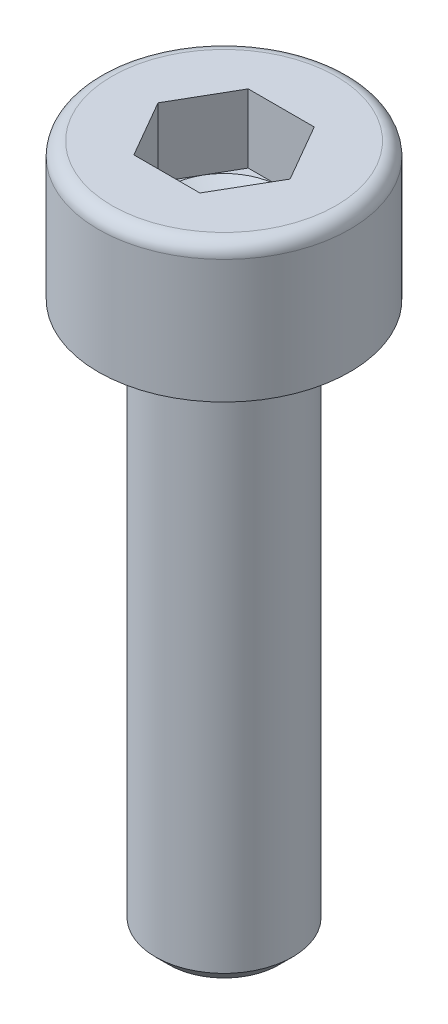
from build123d import *

# Parameters (mm, degrees)
ESQUISSE2_R             = 1.5
BASE_EXTRUSION_DEPTH    = 12
CHANFREIN1_SIZE         = 0.3
ENL_V_MAT_EXTRU_1_DEPTH = 1.5


with BuildPart() as part:
    # Esquisse2 → Base-Extrusion (new body)
    with BuildSketch(Plane(origin=(0, 0, 0), x_dir=(1, 0, 0), z_dir=(0, 1, 0))):
        with Locations(Location((0, 0, 0), (0, 0, 270))):
            Circle(ESQUISSE2_R)
    extrude(amount=-BASE_EXTRUSION_DEPTH)

    # Chanfrein1
    chanfrein1_edges = [part.edges().sort_by_distance(p)[0] for p in [
        (0, -12, -1.5),
    ]]
    chamfer(chanfrein1_edges, length=CHANFREIN1_SIZE)

    # Esquisse5 → Boss.-R_vol.1 (revolve)
    with BuildSketch(Plane.XY, mode=Mode.PRIVATE) as boss_r_vol_1_sk:
        with BuildLine():
            Line((1.25, 3), (1.25, 1.5))
            Line((1.25, 1.5), (0, 0.778312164))
            Line((0, 0.778312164), (0, 0))
            Line((0, 0), (2.75, 0))
            Line((2.75, 0), (2.75, 2.7))
            ThreePointArc((2.75, 2.7), (2.662132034, 2.912132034), (2.45, 3))
            Line((2.45, 3), (1.25, 3))
        make_face()
    revolve(boss_r_vol_1_sk.sketch.rotate(Axis((0, 3, 0), (0, -1, 0)), 90), axis=Axis((0, 3, 0), (0, -1, 0)))

    # Esquisse7 → Enl_v. mat.-Extru.1 (cut)
    with BuildSketch(Plane(origin=(0, 3, 0), x_dir=(-1, 0, 0), z_dir=(0, 1, 0))):
        Polygon((0.721687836, 1.25), (-0.721687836, 1.25), (-1.443375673, 0), (-0.721687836, -1.25), (0.721687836, -1.25), (1.443375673, 0), align=None)
    extrude(amount=-ENL_V_MAT_EXTRU_1_DEPTH, mode=Mode.SUBTRACT)


solid = part.part
